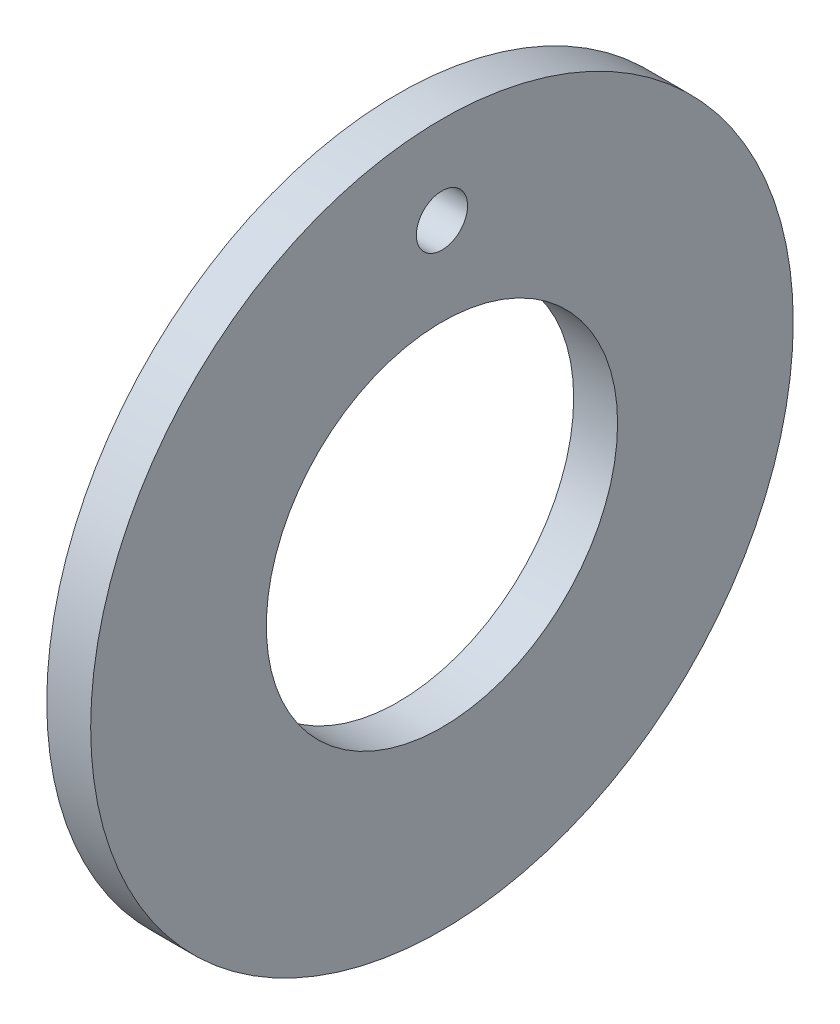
ISO-10303-21;
HEADER;
FILE_DESCRIPTION(('STEP AP214'),'2;1');
FILE_NAME('part.step','',(''),(''),'','','');
FILE_SCHEMA(('AUTOMOTIVE_DESIGN { 1 0 10303 214 1 1 1 1 }'));
ENDSEC;
DATA;
#1=APPLICATION_CONTEXT('core data for automotive mechanical design processes');
#2=APPLICATION_PROTOCOL_DEFINITION('international standard','automotive_design',2000,#1);
#3=PRODUCT_CONTEXT('',#1,'mechanical');
#4=PRODUCT('Part','Part','',(#3));
#5=PRODUCT_RELATED_PRODUCT_CATEGORY('part','',(#4));
#6=PRODUCT_DEFINITION_FORMATION('','',#4);
#7=PRODUCT_DEFINITION_CONTEXT('part definition',#1,'design');
#8=PRODUCT_DEFINITION('design','',#6,#7);
#9=PRODUCT_DEFINITION_SHAPE('','',#8);
#10=(LENGTH_UNIT() NAMED_UNIT(*) SI_UNIT(.MILLI.,.METRE.));
#11=(NAMED_UNIT(*) PLANE_ANGLE_UNIT() SI_UNIT($,.RADIAN.));
#12=(NAMED_UNIT(*) SI_UNIT($,.STERADIAN.) SOLID_ANGLE_UNIT());
#13=UNCERTAINTY_MEASURE_WITH_UNIT(LENGTH_MEASURE(1.E-05),#10,'distance_accuracy_value','');
#14=(GEOMETRIC_REPRESENTATION_CONTEXT(3) GLOBAL_UNCERTAINTY_ASSIGNED_CONTEXT((#13)) GLOBAL_UNIT_ASSIGNED_CONTEXT((#10,
#11,#12)) REPRESENTATION_CONTEXT('',''));
#15=CARTESIAN_POINT('',(0.,0.,0.));
#16=DIRECTION('',(0.,0.,1.));
#17=DIRECTION('',(1.,0.,0.));
#18=AXIS2_PLACEMENT_3D('',#15,#16,#17);
#19=CARTESIAN_POINT('',(0.,0.,0.));
#20=DIRECTION('',(-1.,0.,0.));
#21=DIRECTION('',(0.,0.,1.));
#22=AXIS2_PLACEMENT_3D('',#19,#20,#21);
#23=PLANE('',#22);
#24=CARTESIAN_POINT('',(0.,0.,0.));
#25=DIRECTION('',(1.,0.,0.));
#26=DIRECTION('',(0.,0.,-1.));
#27=AXIS2_PLACEMENT_3D('',#24,#25,#26);
#28=CIRCLE('',#27,6.);
#29=CARTESIAN_POINT('',(0.,0.,-6.));
#30=VERTEX_POINT('',#29);
#31=EDGE_CURVE('E8',#30,#30,#28,.T.);
#32=ORIENTED_EDGE('',*,*,#31,.T.);
#33=EDGE_LOOP('',(#32));
#34=FACE_BOUND('',#33,.T.);
#35=CARTESIAN_POINT('',(0.,9.,0.));
#36=DIRECTION('',(1.,0.,0.));
#37=DIRECTION('',(0.,0.,-1.));
#38=AXIS2_PLACEMENT_3D('',#35,#36,#37);
#39=CIRCLE('',#38,0.875);
#40=CARTESIAN_POINT('',(0.,9.,-0.875));
#41=VERTEX_POINT('',#40);
#42=EDGE_CURVE('E20',#41,#41,#39,.T.);
#43=ORIENTED_EDGE('',*,*,#42,.T.);
#44=EDGE_LOOP('',(#43));
#45=FACE_BOUND('',#44,.T.);
#46=CARTESIAN_POINT('',(0.,0.,0.));
#47=DIRECTION('',(1.,0.,0.));
#48=DIRECTION('',(0.,0.,-1.));
#49=AXIS2_PLACEMENT_3D('',#46,#47,#48);
#50=CIRCLE('',#49,12.);
#51=CARTESIAN_POINT('',(0.,0.,-12.));
#52=VERTEX_POINT('',#51);
#53=EDGE_CURVE('E28',#52,#52,#50,.T.);
#54=ORIENTED_EDGE('',*,*,#53,.F.);
#55=EDGE_LOOP('',(#54));
#56=FACE_BOUND('',#55,.T.);
#57=ADVANCED_FACE('F13',(#34,#45,#56),#23,.T.);
#58=CARTESIAN_POINT('',(1.5,0.,0.));
#59=DIRECTION('',(1.,0.,0.));
#60=DIRECTION('',(0.,0.,-1.));
#61=AXIS2_PLACEMENT_3D('',#58,#59,#60);
#62=PLANE('',#61);
#63=CARTESIAN_POINT('',(1.5,0.,0.));
#64=DIRECTION('',(1.,0.,0.));
#65=DIRECTION('',(0.,0.,-1.));
#66=AXIS2_PLACEMENT_3D('',#63,#64,#65);
#67=CIRCLE('',#66,6.);
#68=CARTESIAN_POINT('',(1.5,0.,-6.));
#69=VERTEX_POINT('',#68);
#70=EDGE_CURVE('E24',#69,#69,#67,.T.);
#71=ORIENTED_EDGE('',*,*,#70,.F.);
#72=EDGE_LOOP('',(#71));
#73=FACE_BOUND('',#72,.T.);
#74=CARTESIAN_POINT('',(1.5,9.,0.));
#75=DIRECTION('',(1.,0.,0.));
#76=DIRECTION('',(0.,0.,-1.));
#77=AXIS2_PLACEMENT_3D('',#74,#75,#76);
#78=CIRCLE('',#77,0.875);
#79=CARTESIAN_POINT('',(1.5,9.,-0.875));
#80=VERTEX_POINT('',#79);
#81=EDGE_CURVE('E34',#80,#80,#78,.T.);
#82=ORIENTED_EDGE('',*,*,#81,.F.);
#83=EDGE_LOOP('',(#82));
#84=FACE_BOUND('',#83,.T.);
#85=CARTESIAN_POINT('',(1.5,0.,0.));
#86=DIRECTION('',(-1.,0.,0.));
#87=DIRECTION('',(0.,0.,-1.));
#88=AXIS2_PLACEMENT_3D('',#85,#86,#87);
#89=CIRCLE('',#88,12.);
#90=CARTESIAN_POINT('',(1.5,0.,-12.));
#91=VERTEX_POINT('',#90);
#92=EDGE_CURVE('E33',#91,#91,#89,.T.);
#93=ORIENTED_EDGE('',*,*,#92,.F.);
#94=EDGE_LOOP('',(#93));
#95=FACE_BOUND('',#94,.T.);
#96=ADVANCED_FACE('F43',(#73,#84,#95),#62,.T.);
#97=CARTESIAN_POINT('',(0.,0.,0.));
#98=DIRECTION('',(1.,0.,0.));
#99=DIRECTION('',(0.,0.,-1.));
#100=AXIS2_PLACEMENT_3D('',#97,#98,#99);
#101=CYLINDRICAL_SURFACE('',#100,6.);
#102=ORIENTED_EDGE('',*,*,#31,.F.);
#103=EDGE_LOOP('',(#102));
#104=FACE_BOUND('',#103,.T.);
#105=ORIENTED_EDGE('',*,*,#70,.T.);
#106=EDGE_LOOP('',(#105));
#107=FACE_BOUND('',#106,.T.);
#108=ADVANCED_FACE('F45',(#104,#107),#101,.F.);
#109=CARTESIAN_POINT('',(0.,9.,0.));
#110=DIRECTION('',(1.,0.,0.));
#111=DIRECTION('',(0.,0.,-1.));
#112=AXIS2_PLACEMENT_3D('',#109,#110,#111);
#113=CYLINDRICAL_SURFACE('',#112,0.875);
#114=ORIENTED_EDGE('',*,*,#42,.F.);
#115=EDGE_LOOP('',(#114));
#116=FACE_BOUND('',#115,.T.);
#117=ORIENTED_EDGE('',*,*,#81,.T.);
#118=EDGE_LOOP('',(#117));
#119=FACE_BOUND('',#118,.T.);
#120=ADVANCED_FACE('F15',(#116,#119),#113,.F.);
#121=CARTESIAN_POINT('',(0.,0.,0.));
#122=DIRECTION('',(1.,0.,0.));
#123=DIRECTION('',(0.,0.,-1.));
#124=AXIS2_PLACEMENT_3D('',#121,#122,#123);
#125=CYLINDRICAL_SURFACE('',#124,12.);
#126=ORIENTED_EDGE('',*,*,#92,.T.);
#127=EDGE_LOOP('',(#126));
#128=FACE_BOUND('',#127,.T.);
#129=ORIENTED_EDGE('',*,*,#53,.T.);
#130=EDGE_LOOP('',(#129));
#131=FACE_BOUND('',#130,.T.);
#132=ADVANCED_FACE('F40',(#128,#131),#125,.T.);
#133=CLOSED_SHELL('',(#57,#96,#108,#120,#132));
#134=MANIFOLD_SOLID_BREP('B1',#133);
#135=ADVANCED_BREP_SHAPE_REPRESENTATION('',(#18,#134),#14);
#136=SHAPE_DEFINITION_REPRESENTATION(#9,#135);
ENDSEC;
END-ISO-10303-21;
